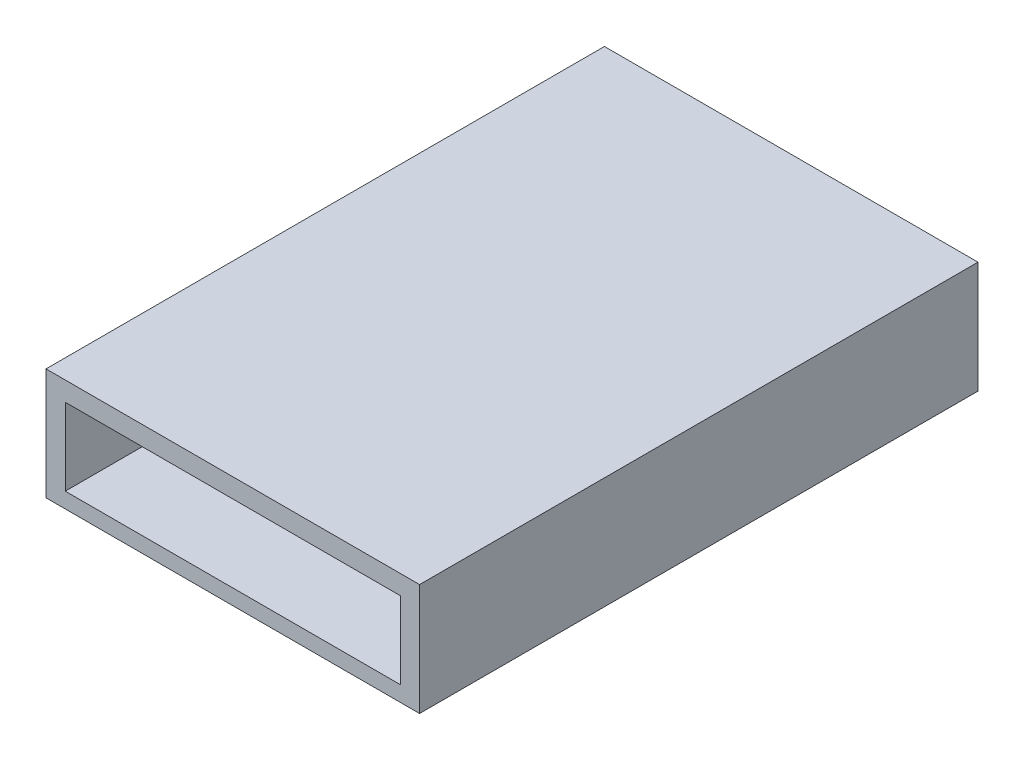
ISO-10303-21;
HEADER;
FILE_DESCRIPTION(('STEP AP214'),'2;1');
FILE_NAME('part.step','',(''),(''),'','','');
FILE_SCHEMA(('AUTOMOTIVE_DESIGN { 1 0 10303 214 1 1 1 1 }'));
ENDSEC;
DATA;
#1=APPLICATION_CONTEXT('core data for automotive mechanical design processes');
#2=APPLICATION_PROTOCOL_DEFINITION('international standard','automotive_design',2000,#1);
#3=PRODUCT_CONTEXT('',#1,'mechanical');
#4=PRODUCT('Part','Part','',(#3));
#5=PRODUCT_RELATED_PRODUCT_CATEGORY('part','',(#4));
#6=PRODUCT_DEFINITION_FORMATION('','',#4);
#7=PRODUCT_DEFINITION_CONTEXT('part definition',#1,'design');
#8=PRODUCT_DEFINITION('design','',#6,#7);
#9=PRODUCT_DEFINITION_SHAPE('','',#8);
#10=(LENGTH_UNIT() NAMED_UNIT(*) SI_UNIT(.MILLI.,.METRE.));
#11=(NAMED_UNIT(*) PLANE_ANGLE_UNIT() SI_UNIT($,.RADIAN.));
#12=(NAMED_UNIT(*) SI_UNIT($,.STERADIAN.) SOLID_ANGLE_UNIT());
#13=UNCERTAINTY_MEASURE_WITH_UNIT(LENGTH_MEASURE(1.E-05),#10,'distance_accuracy_value','');
#14=(GEOMETRIC_REPRESENTATION_CONTEXT(3) GLOBAL_UNCERTAINTY_ASSIGNED_CONTEXT((#13)) GLOBAL_UNIT_ASSIGNED_CONTEXT((#10,
#11,#12)) REPRESENTATION_CONTEXT('',''));
#15=CARTESIAN_POINT('',(0.,0.,0.));
#16=DIRECTION('',(0.,0.,1.));
#17=DIRECTION('',(1.,0.,0.));
#18=AXIS2_PLACEMENT_3D('',#15,#16,#17);
#19=CARTESIAN_POINT('',(0.,0.,29.));
#20=DIRECTION('',(1.,0.,0.));
#21=DIRECTION('',(0.,0.,-1.));
#22=AXIS2_PLACEMENT_3D('',#19,#20,#21);
#23=PLANE('',#22);
#24=DIRECTION('',(0.,-1.,0.));
#25=VECTOR('',#24,1.);
#26=CARTESIAN_POINT('',(0.,0.,0.));
#27=LINE('',#26,#25);
#28=CARTESIAN_POINT('',(0.,5.8,0.));
#29=VERTEX_POINT('',#28);
#30=CARTESIAN_POINT('',(0.,0.,0.));
#31=VERTEX_POINT('',#30);
#32=EDGE_CURVE('E211',#29,#31,#27,.T.);
#33=ORIENTED_EDGE('',*,*,#32,.T.);
#34=DIRECTION('',(0.,0.,-1.));
#35=VECTOR('',#34,1.);
#36=CARTESIAN_POINT('',(0.,0.,29.));
#37=LINE('',#36,#35);
#38=CARTESIAN_POINT('',(0.,0.,29.));
#39=VERTEX_POINT('',#38);
#40=EDGE_CURVE('E244',#39,#31,#37,.T.);
#41=ORIENTED_EDGE('',*,*,#40,.F.);
#42=DIRECTION('',(0.,-1.,0.));
#43=VECTOR('',#42,1.);
#44=CARTESIAN_POINT('',(0.,0.,29.));
#45=LINE('',#44,#43);
#46=CARTESIAN_POINT('',(0.,5.8,29.));
#47=VERTEX_POINT('',#46);
#48=EDGE_CURVE('E218',#47,#39,#45,.T.);
#49=ORIENTED_EDGE('',*,*,#48,.F.);
#50=DIRECTION('',(0.,0.,-1.));
#51=VECTOR('',#50,1.);
#52=CARTESIAN_POINT('',(0.,5.8,29.));
#53=LINE('',#52,#51);
#54=EDGE_CURVE('E228',#47,#29,#53,.T.);
#55=ORIENTED_EDGE('',*,*,#54,.T.);
#56=EDGE_LOOP('',(#33,#41,#49,#55));
#57=FACE_BOUND('',#56,.T.);
#58=ADVANCED_FACE('F33',(#57),#23,.F.);
#59=CARTESIAN_POINT('',(0.,0.,29.));
#60=DIRECTION('',(0.,1.,0.));
#61=DIRECTION('',(0.,0.,1.));
#62=AXIS2_PLACEMENT_3D('',#59,#60,#61);
#63=PLANE('',#62);
#64=CARTESIAN_POINT('',(15.375,0.,22.765));
#65=DIRECTION('',(0.,-1.,0.));
#66=DIRECTION('',(0.,0.,-1.));
#67=AXIS2_PLACEMENT_3D('',#64,#65,#66);
#68=CIRCLE('',#67,2.425);
#69=CARTESIAN_POINT('',(15.375,0.,20.34));
#70=VERTEX_POINT('',#69);
#71=EDGE_CURVE('E178',#70,#70,#68,.T.);
#72=ORIENTED_EDGE('',*,*,#71,.F.);
#73=EDGE_LOOP('',(#72));
#74=FACE_BOUND('',#73,.T.);
#75=CARTESIAN_POINT('',(7.40499999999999,0.,6.825));
#76=DIRECTION('',(0.,-1.,0.));
#77=DIRECTION('',(0.,0.,-1.));
#78=AXIS2_PLACEMENT_3D('',#75,#76,#77);
#79=CIRCLE('',#78,2.425);
#80=CARTESIAN_POINT('',(7.40499999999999,0.,4.4));
#81=VERTEX_POINT('',#80);
#82=EDGE_CURVE('E166',#81,#81,#79,.T.);
#83=ORIENTED_EDGE('',*,*,#82,.F.);
#84=EDGE_LOOP('',(#83));
#85=FACE_BOUND('',#84,.T.);
#86=DIRECTION('',(1.,0.,0.));
#87=VECTOR('',#86,1.);
#88=CARTESIAN_POINT('',(0.,0.,0.));
#89=LINE('',#88,#87);
#90=CARTESIAN_POINT('',(19.4,0.,0.));
#91=VERTEX_POINT('',#90);
#92=EDGE_CURVE('E231',#31,#91,#89,.T.);
#93=ORIENTED_EDGE('',*,*,#92,.T.);
#94=DIRECTION('',(0.,0.,-1.));
#95=VECTOR('',#94,1.);
#96=CARTESIAN_POINT('',(19.4,0.,29.));
#97=LINE('',#96,#95);
#98=CARTESIAN_POINT('',(19.4,0.,29.));
#99=VERTEX_POINT('',#98);
#100=EDGE_CURVE('E241',#99,#91,#97,.T.);
#101=ORIENTED_EDGE('',*,*,#100,.F.);
#102=DIRECTION('',(1.,0.,0.));
#103=VECTOR('',#102,1.);
#104=CARTESIAN_POINT('',(0.,0.,29.));
#105=LINE('',#104,#103);
#106=EDGE_CURVE('E221',#39,#99,#105,.T.);
#107=ORIENTED_EDGE('',*,*,#106,.F.);
#108=ORIENTED_EDGE('',*,*,#40,.T.);
#109=EDGE_LOOP('',(#93,#101,#107,#108));
#110=FACE_BOUND('',#109,.T.);
#111=ADVANCED_FACE('F278',(#74,#85,#110),#63,.F.);
#112=CARTESIAN_POINT('',(19.4,0.,29.));
#113=DIRECTION('',(-1.,0.,0.));
#114=DIRECTION('',(0.,0.,1.));
#115=AXIS2_PLACEMENT_3D('',#112,#113,#114);
#116=PLANE('',#115);
#117=DIRECTION('',(0.,1.,0.));
#118=VECTOR('',#117,1.);
#119=CARTESIAN_POINT('',(19.4,0.,0.));
#120=LINE('',#119,#118);
#121=CARTESIAN_POINT('',(19.4,5.8,0.));
#122=VERTEX_POINT('',#121);
#123=EDGE_CURVE('E233',#91,#122,#120,.T.);
#124=ORIENTED_EDGE('',*,*,#123,.T.);
#125=DIRECTION('',(0.,0.,-1.));
#126=VECTOR('',#125,1.);
#127=CARTESIAN_POINT('',(19.4,5.8,29.));
#128=LINE('',#127,#126);
#129=CARTESIAN_POINT('',(19.4,5.8,29.));
#130=VERTEX_POINT('',#129);
#131=EDGE_CURVE('E238',#130,#122,#128,.T.);
#132=ORIENTED_EDGE('',*,*,#131,.F.);
#133=DIRECTION('',(0.,1.,0.));
#134=VECTOR('',#133,1.);
#135=CARTESIAN_POINT('',(19.4,0.,29.));
#136=LINE('',#135,#134);
#137=EDGE_CURVE('E224',#99,#130,#136,.T.);
#138=ORIENTED_EDGE('',*,*,#137,.F.);
#139=ORIENTED_EDGE('',*,*,#100,.T.);
#140=EDGE_LOOP('',(#124,#132,#138,#139));
#141=FACE_BOUND('',#140,.T.);
#142=ADVANCED_FACE('F283',(#141),#116,.F.);
#143=CARTESIAN_POINT('',(0.,5.8,29.));
#144=DIRECTION('',(0.,-1.,0.));
#145=DIRECTION('',(0.,0.,-1.));
#146=AXIS2_PLACEMENT_3D('',#143,#144,#145);
#147=PLANE('',#146);
#148=DIRECTION('',(-1.,0.,0.));
#149=VECTOR('',#148,1.);
#150=CARTESIAN_POINT('',(0.,5.8,0.));
#151=LINE('',#150,#149);
#152=EDGE_CURVE('E222',#122,#29,#151,.T.);
#153=ORIENTED_EDGE('',*,*,#152,.T.);
#154=ORIENTED_EDGE('',*,*,#54,.F.);
#155=DIRECTION('',(-1.,0.,0.));
#156=VECTOR('',#155,1.);
#157=CARTESIAN_POINT('',(0.,5.8,29.));
#158=LINE('',#157,#156);
#159=EDGE_CURVE('E226',#130,#47,#158,.T.);
#160=ORIENTED_EDGE('',*,*,#159,.F.);
#161=ORIENTED_EDGE('',*,*,#131,.T.);
#162=EDGE_LOOP('',(#153,#154,#160,#161));
#163=FACE_BOUND('',#162,.T.);
#164=ADVANCED_FACE('F299',(#163),#147,.F.);
#165=CARTESIAN_POINT('',(0.,0.,29.));
#166=DIRECTION('',(0.,0.,-1.));
#167=DIRECTION('',(-1.,0.,0.));
#168=AXIS2_PLACEMENT_3D('',#165,#166,#167);
#169=PLANE('',#168);
#170=DIRECTION('',(1.,0.,0.));
#171=VECTOR('',#170,1.);
#172=CARTESIAN_POINT('',(1.,0.8,29.));
#173=LINE('',#172,#171);
#174=CARTESIAN_POINT('',(1.,0.8,29.));
#175=VERTEX_POINT('',#174);
#176=CARTESIAN_POINT('',(18.4,0.8,29.));
#177=VERTEX_POINT('',#176);
#178=EDGE_CURVE('E201',#175,#177,#173,.T.);
#179=ORIENTED_EDGE('',*,*,#178,.F.);
#180=DIRECTION('',(0.,-1.,0.));
#181=VECTOR('',#180,1.);
#182=CARTESIAN_POINT('',(1.,4.8,29.));
#183=LINE('',#182,#181);
#184=CARTESIAN_POINT('',(1.,4.8,29.));
#185=VERTEX_POINT('',#184);
#186=EDGE_CURVE('E177',#185,#175,#183,.T.);
#187=ORIENTED_EDGE('',*,*,#186,.F.);
#188=DIRECTION('',(-1.,0.,0.));
#189=VECTOR('',#188,1.);
#190=CARTESIAN_POINT('',(1.,4.8,29.));
#191=LINE('',#190,#189);
#192=CARTESIAN_POINT('',(18.4,4.8,29.));
#193=VERTEX_POINT('',#192);
#194=EDGE_CURVE('E190',#193,#185,#191,.T.);
#195=ORIENTED_EDGE('',*,*,#194,.F.);
#196=DIRECTION('',(0.,1.,0.));
#197=VECTOR('',#196,1.);
#198=CARTESIAN_POINT('',(18.4,4.8,29.));
#199=LINE('',#198,#197);
#200=EDGE_CURVE('E204',#177,#193,#199,.T.);
#201=ORIENTED_EDGE('',*,*,#200,.F.);
#202=EDGE_LOOP('',(#179,#187,#195,#201));
#203=FACE_BOUND('',#202,.T.);
#204=ORIENTED_EDGE('',*,*,#48,.T.);
#205=ORIENTED_EDGE('',*,*,#106,.T.);
#206=ORIENTED_EDGE('',*,*,#137,.T.);
#207=ORIENTED_EDGE('',*,*,#159,.T.);
#208=EDGE_LOOP('',(#204,#205,#206,#207));
#209=FACE_BOUND('',#208,.T.);
#210=ADVANCED_FACE('F295',(#203,#209),#169,.F.);
#211=CARTESIAN_POINT('',(0.,0.,0.));
#212=DIRECTION('',(0.,0.,-1.));
#213=DIRECTION('',(-1.,0.,0.));
#214=AXIS2_PLACEMENT_3D('',#211,#212,#213);
#215=PLANE('',#214);
#216=DIRECTION('',(0.,1.,0.));
#217=VECTOR('',#216,1.);
#218=CARTESIAN_POINT('',(5.7,0.,0.));
#219=LINE('',#218,#217);
#220=CARTESIAN_POINT('',(5.7,3.3,0.));
#221=VERTEX_POINT('',#220);
#222=CARTESIAN_POINT('',(5.7,4.7,0.));
#223=VERTEX_POINT('',#222);
#224=EDGE_CURVE('E11',#221,#223,#219,.T.);
#225=ORIENTED_EDGE('',*,*,#224,.F.);
#226=DIRECTION('',(-0.650791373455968,0.759256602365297,0.));
#227=VECTOR('',#226,1.);
#228=CARTESIAN_POINT('',(4.91647058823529,4.21411764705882,0.));
#229=LINE('',#228,#227);
#230=CARTESIAN_POINT('',(6.9,1.9,0.));
#231=VERTEX_POINT('',#230);
#232=EDGE_CURVE('E138',#231,#221,#229,.T.);
#233=ORIENTED_EDGE('',*,*,#232,.F.);
#234=DIRECTION('',(-1.,0.,0.));
#235=VECTOR('',#234,1.);
#236=CARTESIAN_POINT('',(0.,1.9,0.));
#237=LINE('',#236,#235);
#238=CARTESIAN_POINT('',(12.5,1.9,0.));
#239=VERTEX_POINT('',#238);
#240=EDGE_CURVE('E248',#239,#231,#237,.T.);
#241=ORIENTED_EDGE('',*,*,#240,.F.);
#242=DIRECTION('',(-0.650791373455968,-0.759256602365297,0.));
#243=VECTOR('',#242,1.);
#244=CARTESIAN_POINT('',(6.26705882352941,-5.37176470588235,0.));
#245=LINE('',#244,#243);
#246=CARTESIAN_POINT('',(13.7,3.3,0.));
#247=VERTEX_POINT('',#246);
#248=EDGE_CURVE('E250',#247,#239,#245,.T.);
#249=ORIENTED_EDGE('',*,*,#248,.F.);
#250=DIRECTION('',(0.,-1.,0.));
#251=VECTOR('',#250,1.);
#252=CARTESIAN_POINT('',(13.7,0.,0.));
#253=LINE('',#252,#251);
#254=CARTESIAN_POINT('',(13.7,4.7,0.));
#255=VERTEX_POINT('',#254);
#256=EDGE_CURVE('E252',#255,#247,#253,.T.);
#257=ORIENTED_EDGE('',*,*,#256,.F.);
#258=DIRECTION('',(1.,0.,0.));
#259=VECTOR('',#258,1.);
#260=CARTESIAN_POINT('',(0.,4.7,0.));
#261=LINE('',#260,#259);
#262=EDGE_CURVE('E40',#223,#255,#261,.T.);
#263=ORIENTED_EDGE('',*,*,#262,.F.);
#264=EDGE_LOOP('',(#225,#233,#241,#249,#257,#263));
#265=FACE_BOUND('',#264,.T.);
#266=ORIENTED_EDGE('',*,*,#32,.F.);
#267=ORIENTED_EDGE('',*,*,#152,.F.);
#268=ORIENTED_EDGE('',*,*,#123,.F.);
#269=ORIENTED_EDGE('',*,*,#92,.F.);
#270=EDGE_LOOP('',(#266,#267,#268,#269));
#271=FACE_BOUND('',#270,.T.);
#272=ADVANCED_FACE('F261',(#265,#271),#215,.T.);
#273=CARTESIAN_POINT('',(1.,4.8,1.));
#274=DIRECTION('',(-1.,0.,0.));
#275=DIRECTION('',(0.,-1.,0.));
#276=AXIS2_PLACEMENT_3D('',#273,#274,#275);
#277=PLANE('',#276);
#278=ORIENTED_EDGE('',*,*,#186,.T.);
#279=DIRECTION('',(0.,0.,1.));
#280=VECTOR('',#279,1.);
#281=CARTESIAN_POINT('',(1.,0.8,1.));
#282=LINE('',#281,#280);
#283=CARTESIAN_POINT('',(1.,0.8,1.));
#284=VERTEX_POINT('',#283);
#285=EDGE_CURVE('E199',#284,#175,#282,.T.);
#286=ORIENTED_EDGE('',*,*,#285,.F.);
#287=DIRECTION('',(0.,-1.,0.));
#288=VECTOR('',#287,1.);
#289=CARTESIAN_POINT('',(1.,4.8,1.));
#290=LINE('',#289,#288);
#291=CARTESIAN_POINT('',(1.,4.8,1.));
#292=VERTEX_POINT('',#291);
#293=EDGE_CURVE('E186',#292,#284,#290,.T.);
#294=ORIENTED_EDGE('',*,*,#293,.F.);
#295=DIRECTION('',(0.,0.,1.));
#296=VECTOR('',#295,1.);
#297=CARTESIAN_POINT('',(1.,4.8,1.));
#298=LINE('',#297,#296);
#299=EDGE_CURVE('E209',#292,#185,#298,.T.);
#300=ORIENTED_EDGE('',*,*,#299,.T.);
#301=EDGE_LOOP('',(#278,#286,#294,#300));
#302=FACE_BOUND('',#301,.T.);
#303=ADVANCED_FACE('F310',(#302),#277,.F.);
#304=CARTESIAN_POINT('',(1.,4.8,1.));
#305=DIRECTION('',(0.,1.,0.));
#306=DIRECTION('',(0.,0.,1.));
#307=AXIS2_PLACEMENT_3D('',#304,#305,#306);
#308=PLANE('',#307);
#309=ORIENTED_EDGE('',*,*,#194,.T.);
#310=ORIENTED_EDGE('',*,*,#299,.F.);
#311=DIRECTION('',(-1.,0.,0.));
#312=VECTOR('',#311,1.);
#313=CARTESIAN_POINT('',(1.,4.8,1.));
#314=LINE('',#313,#312);
#315=CARTESIAN_POINT('',(18.4,4.8,1.));
#316=VERTEX_POINT('',#315);
#317=EDGE_CURVE('E196',#316,#292,#314,.T.);
#318=ORIENTED_EDGE('',*,*,#317,.F.);
#319=DIRECTION('',(0.,0.,1.));
#320=VECTOR('',#319,1.);
#321=CARTESIAN_POINT('',(18.4,4.8,1.));
#322=LINE('',#321,#320);
#323=EDGE_CURVE('E212',#316,#193,#322,.T.);
#324=ORIENTED_EDGE('',*,*,#323,.T.);
#325=EDGE_LOOP('',(#309,#310,#318,#324));
#326=FACE_BOUND('',#325,.T.);
#327=ADVANCED_FACE('F316',(#326),#308,.F.);
#328=CARTESIAN_POINT('',(18.4,4.8,1.));
#329=DIRECTION('',(1.,0.,0.));
#330=DIRECTION('',(0.,0.,-1.));
#331=AXIS2_PLACEMENT_3D('',#328,#329,#330);
#332=PLANE('',#331);
#333=ORIENTED_EDGE('',*,*,#200,.T.);
#334=ORIENTED_EDGE('',*,*,#323,.F.);
#335=DIRECTION('',(0.,1.,0.));
#336=VECTOR('',#335,1.);
#337=CARTESIAN_POINT('',(18.4,4.8,1.));
#338=LINE('',#337,#336);
#339=CARTESIAN_POINT('',(18.4,0.8,1.));
#340=VERTEX_POINT('',#339);
#341=EDGE_CURVE('E193',#340,#316,#338,.T.);
#342=ORIENTED_EDGE('',*,*,#341,.F.);
#343=DIRECTION('',(0.,0.,1.));
#344=VECTOR('',#343,1.);
#345=CARTESIAN_POINT('',(18.4,0.8,1.));
#346=LINE('',#345,#344);
#347=EDGE_CURVE('E214',#340,#177,#346,.T.);
#348=ORIENTED_EDGE('',*,*,#347,.T.);
#349=EDGE_LOOP('',(#333,#334,#342,#348));
#350=FACE_BOUND('',#349,.T.);
#351=ADVANCED_FACE('F321',(#350),#332,.F.);
#352=CARTESIAN_POINT('',(1.,0.8,1.));
#353=DIRECTION('',(0.,-1.,0.));
#354=DIRECTION('',(0.,0.,-1.));
#355=AXIS2_PLACEMENT_3D('',#352,#353,#354);
#356=PLANE('',#355);
#357=CARTESIAN_POINT('',(15.375,0.8,22.765));
#358=DIRECTION('',(0.,-1.,0.));
#359=DIRECTION('',(0.,0.,-1.));
#360=AXIS2_PLACEMENT_3D('',#357,#358,#359);
#361=CIRCLE('',#360,2.425);
#362=CARTESIAN_POINT('',(15.375,0.8,20.34));
#363=VERTEX_POINT('',#362);
#364=EDGE_CURVE('E174',#363,#363,#361,.T.);
#365=ORIENTED_EDGE('',*,*,#364,.T.);
#366=EDGE_LOOP('',(#365));
#367=FACE_BOUND('',#366,.T.);
#368=CARTESIAN_POINT('',(7.40499999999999,0.8,6.825));
#369=DIRECTION('',(0.,-1.,0.));
#370=DIRECTION('',(0.,0.,-1.));
#371=AXIS2_PLACEMENT_3D('',#368,#369,#370);
#372=CIRCLE('',#371,2.425);
#373=CARTESIAN_POINT('',(7.40499999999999,0.8,4.4));
#374=VERTEX_POINT('',#373);
#375=EDGE_CURVE('E181',#374,#374,#372,.T.);
#376=ORIENTED_EDGE('',*,*,#375,.T.);
#377=EDGE_LOOP('',(#376));
#378=FACE_BOUND('',#377,.T.);
#379=ORIENTED_EDGE('',*,*,#178,.T.);
#380=ORIENTED_EDGE('',*,*,#347,.F.);
#381=DIRECTION('',(1.,0.,0.));
#382=VECTOR('',#381,1.);
#383=CARTESIAN_POINT('',(1.,0.8,1.));
#384=LINE('',#383,#382);
#385=EDGE_CURVE('E189',#284,#340,#384,.T.);
#386=ORIENTED_EDGE('',*,*,#385,.F.);
#387=ORIENTED_EDGE('',*,*,#285,.T.);
#388=EDGE_LOOP('',(#379,#380,#386,#387));
#389=FACE_BOUND('',#388,.T.);
#390=ADVANCED_FACE('F318',(#367,#378,#389),#356,.F.);
#391=CARTESIAN_POINT('',(0.,0.,1.));
#392=DIRECTION('',(0.,0.,1.));
#393=DIRECTION('',(1.,0.,0.));
#394=AXIS2_PLACEMENT_3D('',#391,#392,#393);
#395=PLANE('',#394);
#396=DIRECTION('',(0.,-1.,0.));
#397=VECTOR('',#396,1.);
#398=CARTESIAN_POINT('',(5.7,4.7,1.));
#399=LINE('',#398,#397);
#400=CARTESIAN_POINT('',(5.7,4.7,1.));
#401=VERTEX_POINT('',#400);
#402=CARTESIAN_POINT('',(5.7,3.3,1.));
#403=VERTEX_POINT('',#402);
#404=EDGE_CURVE('E144',#401,#403,#399,.T.);
#405=ORIENTED_EDGE('',*,*,#404,.F.);
#406=DIRECTION('',(-1.,0.,0.));
#407=VECTOR('',#406,1.);
#408=CARTESIAN_POINT('',(5.7,4.7,1.));
#409=LINE('',#408,#407);
#410=CARTESIAN_POINT('',(13.7,4.7,1.));
#411=VERTEX_POINT('',#410);
#412=EDGE_CURVE('E141',#411,#401,#409,.T.);
#413=ORIENTED_EDGE('',*,*,#412,.F.);
#414=DIRECTION('',(0.,1.,0.));
#415=VECTOR('',#414,1.);
#416=CARTESIAN_POINT('',(13.7,4.7,1.));
#417=LINE('',#416,#415);
#418=CARTESIAN_POINT('',(13.7,3.3,1.));
#419=VERTEX_POINT('',#418);
#420=EDGE_CURVE('E47',#419,#411,#417,.T.);
#421=ORIENTED_EDGE('',*,*,#420,.F.);
#422=DIRECTION('',(0.650791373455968,0.759256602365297,0.));
#423=VECTOR('',#422,1.);
#424=CARTESIAN_POINT('',(13.7,3.3,1.));
#425=LINE('',#424,#423);
#426=CARTESIAN_POINT('',(12.5,1.9,1.));
#427=VERTEX_POINT('',#426);
#428=EDGE_CURVE('E158',#427,#419,#425,.T.);
#429=ORIENTED_EDGE('',*,*,#428,.F.);
#430=DIRECTION('',(1.,0.,0.));
#431=VECTOR('',#430,1.);
#432=CARTESIAN_POINT('',(12.5,1.9,1.));
#433=LINE('',#432,#431);
#434=CARTESIAN_POINT('',(6.9,1.9,1.));
#435=VERTEX_POINT('',#434);
#436=EDGE_CURVE('E156',#435,#427,#433,.T.);
#437=ORIENTED_EDGE('',*,*,#436,.F.);
#438=DIRECTION('',(0.650791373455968,-0.759256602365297,0.));
#439=VECTOR('',#438,1.);
#440=CARTESIAN_POINT('',(5.7,3.3,1.));
#441=LINE('',#440,#439);
#442=EDGE_CURVE('E135',#403,#435,#441,.T.);
#443=ORIENTED_EDGE('',*,*,#442,.F.);
#444=EDGE_LOOP('',(#405,#413,#421,#429,#437,#443));
#445=FACE_BOUND('',#444,.T.);
#446=ORIENTED_EDGE('',*,*,#293,.T.);
#447=ORIENTED_EDGE('',*,*,#385,.T.);
#448=ORIENTED_EDGE('',*,*,#341,.T.);
#449=ORIENTED_EDGE('',*,*,#317,.T.);
#450=EDGE_LOOP('',(#446,#447,#448,#449));
#451=FACE_BOUND('',#450,.T.);
#452=ADVANCED_FACE('F152',(#445,#451),#395,.T.);
#453=CARTESIAN_POINT('',(7.40499999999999,0.8,6.825));
#454=DIRECTION('',(0.,-1.,0.));
#455=DIRECTION('',(0.,0.,-1.));
#456=AXIS2_PLACEMENT_3D('',#453,#454,#455);
#457=CYLINDRICAL_SURFACE('',#456,2.425);
#458=ORIENTED_EDGE('',*,*,#375,.F.);
#459=EDGE_LOOP('',(#458));
#460=FACE_BOUND('',#459,.T.);
#461=ORIENTED_EDGE('',*,*,#82,.T.);
#462=EDGE_LOOP('',(#461));
#463=FACE_BOUND('',#462,.T.);
#464=ADVANCED_FACE('F331',(#460,#463),#457,.F.);
#465=CARTESIAN_POINT('',(15.375,0.8,22.765));
#466=DIRECTION('',(0.,-1.,0.));
#467=DIRECTION('',(0.,0.,-1.));
#468=AXIS2_PLACEMENT_3D('',#465,#466,#467);
#469=CYLINDRICAL_SURFACE('',#468,2.425);
#470=ORIENTED_EDGE('',*,*,#364,.F.);
#471=EDGE_LOOP('',(#470));
#472=FACE_BOUND('',#471,.T.);
#473=ORIENTED_EDGE('',*,*,#71,.T.);
#474=EDGE_LOOP('',(#473));
#475=FACE_BOUND('',#474,.T.);
#476=ADVANCED_FACE('F334',(#472,#475),#469,.F.);
#477=CARTESIAN_POINT('',(5.7,4.7,-27.));
#478=DIRECTION('',(-1.,0.,0.));
#479=DIRECTION('',(0.,0.,1.));
#480=AXIS2_PLACEMENT_3D('',#477,#478,#479);
#481=PLANE('',#480);
#482=ORIENTED_EDGE('',*,*,#224,.T.);
#483=DIRECTION('',(0.,0.,1.));
#484=VECTOR('',#483,1.);
#485=CARTESIAN_POINT('',(5.7,4.7,-27.));
#486=LINE('',#485,#484);
#487=EDGE_CURVE('E147',#223,#401,#486,.T.);
#488=ORIENTED_EDGE('',*,*,#487,.T.);
#489=ORIENTED_EDGE('',*,*,#404,.T.);
#490=DIRECTION('',(0.,0.,1.));
#491=VECTOR('',#490,1.);
#492=CARTESIAN_POINT('',(5.7,3.3,-27.));
#493=LINE('',#492,#491);
#494=EDGE_CURVE('E131',#221,#403,#493,.T.);
#495=ORIENTED_EDGE('',*,*,#494,.F.);
#496=EDGE_LOOP('',(#482,#488,#489,#495));
#497=FACE_BOUND('',#496,.T.);
#498=ADVANCED_FACE('F145',(#497),#481,.F.);
#499=CARTESIAN_POINT('',(5.7,4.7,-27.));
#500=DIRECTION('',(0.,1.,0.));
#501=DIRECTION('',(-1.,0.,0.));
#502=AXIS2_PLACEMENT_3D('',#499,#500,#501);
#503=PLANE('',#502);
#504=ORIENTED_EDGE('',*,*,#262,.T.);
#505=DIRECTION('',(0.,0.,1.));
#506=VECTOR('',#505,1.);
#507=CARTESIAN_POINT('',(13.7,4.7,-27.));
#508=LINE('',#507,#506);
#509=EDGE_CURVE('E167',#255,#411,#508,.T.);
#510=ORIENTED_EDGE('',*,*,#509,.T.);
#511=ORIENTED_EDGE('',*,*,#412,.T.);
#512=ORIENTED_EDGE('',*,*,#487,.F.);
#513=EDGE_LOOP('',(#504,#510,#511,#512));
#514=FACE_BOUND('',#513,.T.);
#515=ADVANCED_FACE('F255',(#514),#503,.F.);
#516=CARTESIAN_POINT('',(13.7,4.7,-27.));
#517=DIRECTION('',(1.,0.,0.));
#518=DIRECTION('',(0.,0.,-1.));
#519=AXIS2_PLACEMENT_3D('',#516,#517,#518);
#520=PLANE('',#519);
#521=ORIENTED_EDGE('',*,*,#256,.T.);
#522=DIRECTION('',(0.,0.,1.));
#523=VECTOR('',#522,1.);
#524=CARTESIAN_POINT('',(13.7,3.3,-27.));
#525=LINE('',#524,#523);
#526=EDGE_CURVE('E169',#247,#419,#525,.T.);
#527=ORIENTED_EDGE('',*,*,#526,.T.);
#528=ORIENTED_EDGE('',*,*,#420,.T.);
#529=ORIENTED_EDGE('',*,*,#509,.F.);
#530=EDGE_LOOP('',(#521,#527,#528,#529));
#531=FACE_BOUND('',#530,.T.);
#532=ADVANCED_FACE('F258',(#531),#520,.F.);
#533=CARTESIAN_POINT('',(13.7,3.3,-27.));
#534=DIRECTION('',(0.759256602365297,-0.650791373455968,0.));
#535=DIRECTION('',(0.650791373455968,0.759256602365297,0.));
#536=AXIS2_PLACEMENT_3D('',#533,#534,#535);
#537=PLANE('',#536);
#538=ORIENTED_EDGE('',*,*,#248,.T.);
#539=DIRECTION('',(0.,0.,1.));
#540=VECTOR('',#539,1.);
#541=CARTESIAN_POINT('',(12.5,1.9,-27.));
#542=LINE('',#541,#540);
#543=EDGE_CURVE('E171',#239,#427,#542,.T.);
#544=ORIENTED_EDGE('',*,*,#543,.T.);
#545=ORIENTED_EDGE('',*,*,#428,.T.);
#546=ORIENTED_EDGE('',*,*,#526,.F.);
#547=EDGE_LOOP('',(#538,#544,#545,#546));
#548=FACE_BOUND('',#547,.T.);
#549=ADVANCED_FACE('F266',(#548),#537,.F.);
#550=CARTESIAN_POINT('',(12.5,1.9,-27.));
#551=DIRECTION('',(0.,-1.,0.));
#552=DIRECTION('',(0.,0.,-1.));
#553=AXIS2_PLACEMENT_3D('',#550,#551,#552);
#554=PLANE('',#553);
#555=ORIENTED_EDGE('',*,*,#240,.T.);
#556=DIRECTION('',(0.,0.,1.));
#557=VECTOR('',#556,1.);
#558=CARTESIAN_POINT('',(6.9,1.9,-27.));
#559=LINE('',#558,#557);
#560=EDGE_CURVE('E55',#231,#435,#559,.T.);
#561=ORIENTED_EDGE('',*,*,#560,.T.);
#562=ORIENTED_EDGE('',*,*,#436,.T.);
#563=ORIENTED_EDGE('',*,*,#543,.F.);
#564=EDGE_LOOP('',(#555,#561,#562,#563));
#565=FACE_BOUND('',#564,.T.);
#566=ADVANCED_FACE('F268',(#565),#554,.F.);
#567=CARTESIAN_POINT('',(5.7,3.3,-27.));
#568=DIRECTION('',(-0.759256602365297,-0.650791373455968,0.));
#569=DIRECTION('',(0.650791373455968,-0.759256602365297,0.));
#570=AXIS2_PLACEMENT_3D('',#567,#568,#569);
#571=PLANE('',#570);
#572=ORIENTED_EDGE('',*,*,#232,.T.);
#573=ORIENTED_EDGE('',*,*,#494,.T.);
#574=ORIENTED_EDGE('',*,*,#442,.T.);
#575=ORIENTED_EDGE('',*,*,#560,.F.);
#576=EDGE_LOOP('',(#572,#573,#574,#575));
#577=FACE_BOUND('',#576,.T.);
#578=ADVANCED_FACE('F133',(#577),#571,.F.);
#579=CLOSED_SHELL('',(#58,#111,#142,#164,#210,#272,#303,#327,#351,#390,#452,#464,#476,#498,#515,
#532,#549,#566,#578));
#580=MANIFOLD_SOLID_BREP('B2',#579);
#581=ADVANCED_BREP_SHAPE_REPRESENTATION('',(#18,#580),#14);
#582=SHAPE_DEFINITION_REPRESENTATION(#9,#581);
ENDSEC;
END-ISO-10303-21;
